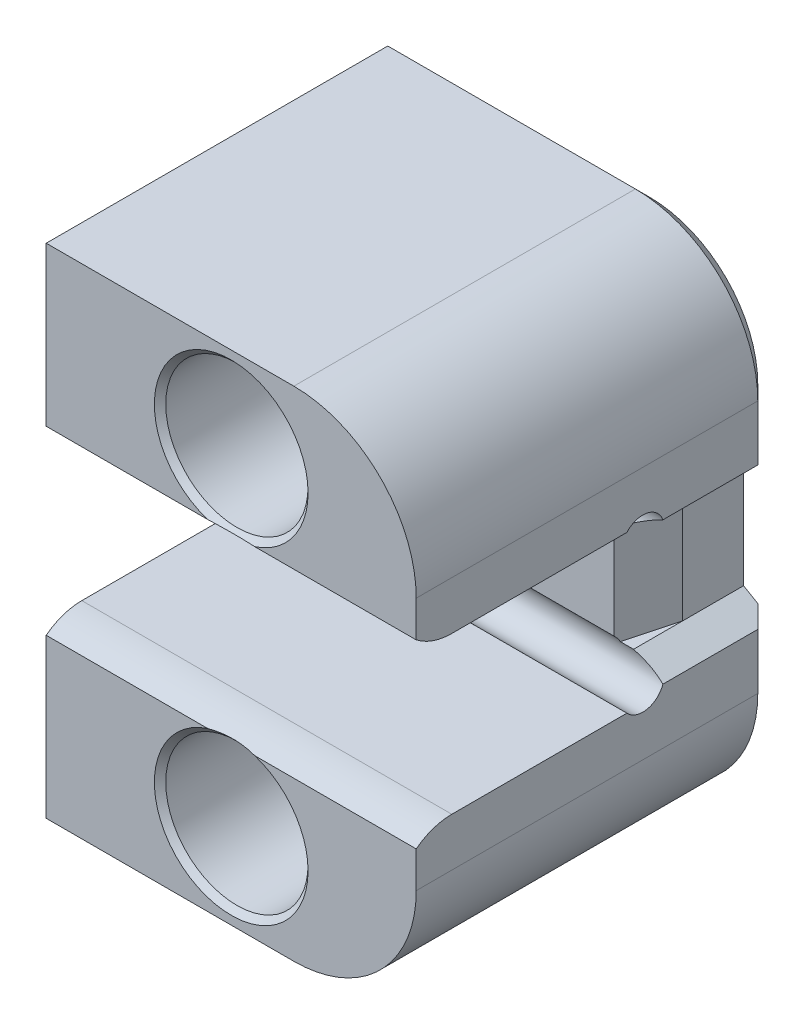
ISO-10303-21;
HEADER;
FILE_DESCRIPTION(('STEP AP214'),'2;1');
FILE_NAME('part.step','',(''),(''),'','','');
FILE_SCHEMA(('AUTOMOTIVE_DESIGN { 1 0 10303 214 1 1 1 1 }'));
ENDSEC;
DATA;
#1=APPLICATION_CONTEXT('core data for automotive mechanical design processes');
#2=APPLICATION_PROTOCOL_DEFINITION('international standard','automotive_design',2000,#1);
#3=PRODUCT_CONTEXT('',#1,'mechanical');
#4=PRODUCT('Part','Part','',(#3));
#5=PRODUCT_RELATED_PRODUCT_CATEGORY('part','',(#4));
#6=PRODUCT_DEFINITION_FORMATION('','',#4);
#7=PRODUCT_DEFINITION_CONTEXT('part definition',#1,'design');
#8=PRODUCT_DEFINITION('design','',#6,#7);
#9=PRODUCT_DEFINITION_SHAPE('','',#8);
#10=(LENGTH_UNIT() NAMED_UNIT(*) SI_UNIT(.MILLI.,.METRE.));
#11=(NAMED_UNIT(*) PLANE_ANGLE_UNIT() SI_UNIT($,.RADIAN.));
#12=(NAMED_UNIT(*) SI_UNIT($,.STERADIAN.) SOLID_ANGLE_UNIT());
#13=UNCERTAINTY_MEASURE_WITH_UNIT(LENGTH_MEASURE(1.E-05),#10,'distance_accuracy_value','');
#14=(GEOMETRIC_REPRESENTATION_CONTEXT(3) GLOBAL_UNCERTAINTY_ASSIGNED_CONTEXT((#13)) GLOBAL_UNIT_ASSIGNED_CONTEXT((#10,
#11,#12)) REPRESENTATION_CONTEXT('',''));
#15=CARTESIAN_POINT('',(0.,0.,0.));
#16=DIRECTION('',(0.,0.,1.));
#17=DIRECTION('',(1.,0.,0.));
#18=AXIS2_PLACEMENT_3D('',#15,#16,#17);
#19=CARTESIAN_POINT('',(13.,-5.5,0.));
#20=DIRECTION('',(-1.,0.,0.));
#21=DIRECTION('',(0.,0.,1.));
#22=AXIS2_PLACEMENT_3D('',#19,#20,#21);
#23=PLANE('',#22);
#24=DIRECTION('',(0.,0.,-1.));
#25=VECTOR('',#24,1.);
#26=CARTESIAN_POINT('',(13.,-8.9,0.));
#27=LINE('',#26,#25);
#28=CARTESIAN_POINT('',(13.,-8.9,0.));
#29=VERTEX_POINT('',#28);
#30=CARTESIAN_POINT('',(13.,-8.9,-24.));
#31=VERTEX_POINT('',#30);
#32=EDGE_CURVE('E282',#29,#31,#27,.T.);
#33=ORIENTED_EDGE('',*,*,#32,.T.);
#34=DIRECTION('',(0.,1.,0.));
#35=VECTOR('',#34,1.);
#36=CARTESIAN_POINT('',(13.,-5.5,-24.));
#37=LINE('',#36,#35);
#38=CARTESIAN_POINT('',(13.,-5.,-24.));
#39=VERTEX_POINT('',#38);
#40=EDGE_CURVE('E301',#31,#39,#37,.T.);
#41=ORIENTED_EDGE('',*,*,#40,.T.);
#42=DIRECTION('',(0.,0.,1.));
#43=VECTOR('',#42,1.);
#44=CARTESIAN_POINT('',(13.,-5.,-25.));
#45=LINE('',#44,#43);
#46=CARTESIAN_POINT('',(13.,-5.,-17.3342135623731));
#47=VERTEX_POINT('',#46);
#48=EDGE_CURVE('E239',#39,#47,#45,.T.);
#49=ORIENTED_EDGE('',*,*,#48,.T.);
#50=CARTESIAN_POINT('',(13.,-4.5,-15.92));
#51=DIRECTION('',(1.,0.,0.));
#52=DIRECTION('',(0.,0.,1.));
#53=AXIS2_PLACEMENT_3D('',#50,#51,#52);
#54=CIRCLE('',#53,1.5);
#55=CARTESIAN_POINT('',(13.,-5.5,-14.8019660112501));
#56=VERTEX_POINT('',#55);
#57=EDGE_CURVE('E479',#56,#47,#54,.T.);
#58=ORIENTED_EDGE('',*,*,#57,.F.);
#59=DIRECTION('',(0.,0.,1.));
#60=VECTOR('',#59,1.);
#61=CARTESIAN_POINT('',(13.,-5.5,-16.92));
#62=LINE('',#61,#60);
#63=CARTESIAN_POINT('',(13.,-5.5,-2.49999999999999));
#64=VERTEX_POINT('',#63);
#65=EDGE_CURVE('E252',#56,#64,#62,.T.);
#66=ORIENTED_EDGE('',*,*,#65,.T.);
#67=CARTESIAN_POINT('',(13.,-9.5673182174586,-2.49999968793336));
#68=DIRECTION('',(-1.,0.,0.));
#69=DIRECTION('',(0.,0.,1.));
#70=AXIS2_PLACEMENT_3D('',#67,#68,#69);
#71=CIRCLE('',#70,4.06731821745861);
#72=CARTESIAN_POINT('',(13.,-6.35903533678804,0.));
#73=VERTEX_POINT('',#72);
#74=EDGE_CURVE('E538',#73,#64,#71,.T.);
#75=ORIENTED_EDGE('',*,*,#74,.F.);
#76=DIRECTION('',(0.,-1.,0.));
#77=VECTOR('',#76,1.);
#78=CARTESIAN_POINT('',(13.,-5.5,0.));
#79=LINE('',#78,#77);
#80=EDGE_CURVE('E254',#73,#29,#79,.T.);
#81=ORIENTED_EDGE('',*,*,#80,.T.);
#82=EDGE_LOOP('',(#33,#41,#49,#58,#66,#75,#81));
#83=FACE_BOUND('',#82,.T.);
#84=ADVANCED_FACE('F33',(#83),#23,.F.);
#85=CARTESIAN_POINT('',(13.,17.5,0.));
#86=DIRECTION('',(0.,0.,-1.));
#87=DIRECTION('',(0.,1.,0.));
#88=AXIS2_PLACEMENT_3D('',#85,#86,#87);
#89=PLANE('',#88);
#90=DIRECTION('',(1.,0.,0.));
#91=VECTOR('',#90,1.);
#92=CARTESIAN_POINT('',(-13.,6.35903533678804,0.));
#93=LINE('',#92,#91);
#94=CARTESIAN_POINT('',(-13.,6.35903533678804,0.));
#95=VERTEX_POINT('',#94);
#96=CARTESIAN_POINT('',(-1.65241711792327,6.35903533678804,0.));
#97=VERTEX_POINT('',#96);
#98=EDGE_CURVE('E539',#95,#97,#93,.T.);
#99=ORIENTED_EDGE('',*,*,#98,.T.);
#100=CARTESIAN_POINT('',(0.,11.5,0.));
#101=DIRECTION('',(0.,0.,-1.));
#102=DIRECTION('',(0.,1.,0.));
#103=AXIS2_PLACEMENT_3D('',#100,#101,#102);
#104=CIRCLE('',#103,5.4);
#105=CARTESIAN_POINT('',(1.65241711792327,6.35903533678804,0.));
#106=VERTEX_POINT('',#105);
#107=EDGE_CURVE('E585',#97,#106,#104,.T.);
#108=ORIENTED_EDGE('',*,*,#107,.T.);
#109=CARTESIAN_POINT('',(13.,6.35903533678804,0.));
#110=VERTEX_POINT('',#109);
#111=EDGE_CURVE('E533',#106,#110,#93,.T.);
#112=ORIENTED_EDGE('',*,*,#111,.T.);
#113=DIRECTION('',(0.,-1.,0.));
#114=VECTOR('',#113,1.);
#115=CARTESIAN_POINT('',(13.,17.5,0.));
#116=LINE('',#115,#114);
#117=CARTESIAN_POINT('',(13.,8.9,0.));
#118=VERTEX_POINT('',#117);
#119=EDGE_CURVE('E245',#118,#110,#116,.T.);
#120=ORIENTED_EDGE('',*,*,#119,.F.);
#121=CARTESIAN_POINT('',(4.4,8.9,0.));
#122=DIRECTION('',(0.,0.,-1.));
#123=DIRECTION('',(0.,1.,0.));
#124=AXIS2_PLACEMENT_3D('',#121,#122,#123);
#125=CIRCLE('',#124,8.6);
#126=CARTESIAN_POINT('',(4.4,17.5,0.));
#127=VERTEX_POINT('',#126);
#128=EDGE_CURVE('E287',#118,#127,#125,.F.);
#129=ORIENTED_EDGE('',*,*,#128,.T.);
#130=DIRECTION('',(-1.,0.,0.));
#131=VECTOR('',#130,1.);
#132=CARTESIAN_POINT('',(13.,17.5,0.));
#133=LINE('',#132,#131);
#134=CARTESIAN_POINT('',(-13.,17.5,0.));
#135=VERTEX_POINT('',#134);
#136=EDGE_CURVE('E256',#127,#135,#133,.T.);
#137=ORIENTED_EDGE('',*,*,#136,.T.);
#138=DIRECTION('',(0.,-1.,0.));
#139=VECTOR('',#138,1.);
#140=CARTESIAN_POINT('',(-13.,17.5,0.));
#141=LINE('',#140,#139);
#142=EDGE_CURVE('E257',#135,#95,#141,.T.);
#143=ORIENTED_EDGE('',*,*,#142,.T.);
#144=EDGE_LOOP('',(#99,#108,#112,#120,#129,#137,#143));
#145=FACE_BOUND('',#144,.T.);
#146=ADVANCED_FACE('F419',(#145),#89,.F.);
#147=CARTESIAN_POINT('',(13.,5.5,0.));
#148=DIRECTION('',(0.,1.,0.));
#149=DIRECTION('',(0.,0.,1.));
#150=AXIS2_PLACEMENT_3D('',#147,#148,#149);
#151=PLANE('',#150);
#152=DIRECTION('',(0.,0.,-1.));
#153=VECTOR('',#152,1.);
#154=CARTESIAN_POINT('',(-13.,5.5,0.));
#155=LINE('',#154,#153);
#156=CARTESIAN_POINT('',(-13.,5.5,-2.49999999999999));
#157=VERTEX_POINT('',#156);
#158=CARTESIAN_POINT('',(-13.,5.5,-14.8019660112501));
#159=VERTEX_POINT('',#158);
#160=EDGE_CURVE('E260',#157,#159,#155,.T.);
#161=ORIENTED_EDGE('',*,*,#160,.T.);
#162=DIRECTION('',(1.,0.,0.));
#163=VECTOR('',#162,1.);
#164=CARTESIAN_POINT('',(-13.,5.5,-14.8019660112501));
#165=LINE('',#164,#163);
#166=CARTESIAN_POINT('',(13.,5.5,-14.8019660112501));
#167=VERTEX_POINT('',#166);
#168=EDGE_CURVE('E526',#159,#167,#165,.T.);
#169=ORIENTED_EDGE('',*,*,#168,.T.);
#170=DIRECTION('',(0.,0.,-1.));
#171=VECTOR('',#170,1.);
#172=CARTESIAN_POINT('',(13.,5.5,0.));
#173=LINE('',#172,#171);
#174=CARTESIAN_POINT('',(13.,5.5,-2.49999999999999));
#175=VERTEX_POINT('',#174);
#176=EDGE_CURVE('E248',#175,#167,#173,.T.);
#177=ORIENTED_EDGE('',*,*,#176,.F.);
#178=DIRECTION('',(1.,0.,0.));
#179=VECTOR('',#178,1.);
#180=CARTESIAN_POINT('',(-13.,5.5,-2.49999999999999));
#181=LINE('',#180,#179);
#182=EDGE_CURVE('E536',#157,#175,#181,.T.);
#183=ORIENTED_EDGE('',*,*,#182,.F.);
#184=EDGE_LOOP('',(#161,#169,#177,#183));
#185=FACE_BOUND('',#184,.T.);
#186=ADVANCED_FACE('F415',(#185),#151,.F.);
#187=CARTESIAN_POINT('',(13.,5.5,-16.92));
#188=DIRECTION('',(0.,0.,-1.));
#189=DIRECTION('',(-1.,0.,0.));
#190=AXIS2_PLACEMENT_3D('',#187,#188,#189);
#191=PLANE('',#190);
#192=DIRECTION('',(1.,0.,0.));
#193=VECTOR('',#192,1.);
#194=CARTESIAN_POINT('',(-13.,-3.38196601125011,-16.92));
#195=LINE('',#194,#193);
#196=CARTESIAN_POINT('',(-13.,-3.3819660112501,-16.92));
#197=VERTEX_POINT('',#196);
#198=CARTESIAN_POINT('',(9.98179306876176,-3.3819660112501,-16.92));
#199=VERTEX_POINT('',#198);
#200=EDGE_CURVE('E514',#197,#199,#195,.T.);
#201=ORIENTED_EDGE('',*,*,#200,.T.);
#202=DIRECTION('',(0.,1.,0.));
#203=VECTOR('',#202,1.);
#204=CARTESIAN_POINT('',(9.98179306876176,-3.84529946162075,-16.92));
#205=LINE('',#204,#203);
#206=CARTESIAN_POINT('',(9.98179306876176,3.3819660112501,-16.92));
#207=VERTEX_POINT('',#206);
#208=EDGE_CURVE('E215',#199,#207,#205,.T.);
#209=ORIENTED_EDGE('',*,*,#208,.T.);
#210=DIRECTION('',(1.,0.,0.));
#211=VECTOR('',#210,1.);
#212=CARTESIAN_POINT('',(-13.,3.38196601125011,-16.92));
#213=LINE('',#212,#211);
#214=CARTESIAN_POINT('',(-13.,3.3819660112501,-16.92));
#215=VERTEX_POINT('',#214);
#216=EDGE_CURVE('E523',#207,#215,#213,.F.);
#217=ORIENTED_EDGE('',*,*,#216,.T.);
#218=DIRECTION('',(0.,-1.,0.));
#219=VECTOR('',#218,1.);
#220=CARTESIAN_POINT('',(-13.,5.5,-16.92));
#221=LINE('',#220,#219);
#222=EDGE_CURVE('E263',#215,#197,#221,.T.);
#223=ORIENTED_EDGE('',*,*,#222,.T.);
#224=EDGE_LOOP('',(#201,#209,#217,#223));
#225=FACE_BOUND('',#224,.T.);
#226=ADVANCED_FACE('F411',(#225),#191,.F.);
#227=CARTESIAN_POINT('',(13.,-5.5,-16.92));
#228=DIRECTION('',(0.,-1.,0.));
#229=DIRECTION('',(0.,0.,-1.));
#230=AXIS2_PLACEMENT_3D('',#227,#228,#229);
#231=PLANE('',#230);
#232=ORIENTED_EDGE('',*,*,#65,.F.);
#233=DIRECTION('',(1.,0.,0.));
#234=VECTOR('',#233,1.);
#235=CARTESIAN_POINT('',(-13.,-5.5,-14.8019660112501));
#236=LINE('',#235,#234);
#237=CARTESIAN_POINT('',(-13.,-5.5,-14.8019660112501));
#238=VERTEX_POINT('',#237);
#239=EDGE_CURVE('E486',#56,#238,#236,.F.);
#240=ORIENTED_EDGE('',*,*,#239,.T.);
#241=DIRECTION('',(0.,0.,1.));
#242=VECTOR('',#241,1.);
#243=CARTESIAN_POINT('',(-13.,-5.5,-16.92));
#244=LINE('',#243,#242);
#245=CARTESIAN_POINT('',(-13.,-5.5,-2.49999999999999));
#246=VERTEX_POINT('',#245);
#247=EDGE_CURVE('E266',#238,#246,#244,.T.);
#248=ORIENTED_EDGE('',*,*,#247,.T.);
#249=DIRECTION('',(1.,0.,0.));
#250=VECTOR('',#249,1.);
#251=CARTESIAN_POINT('',(-13.,-5.5,-2.49999999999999));
#252=LINE('',#251,#250);
#253=EDGE_CURVE('E545',#246,#64,#252,.T.);
#254=ORIENTED_EDGE('',*,*,#253,.T.);
#255=EDGE_LOOP('',(#232,#240,#248,#254));
#256=FACE_BOUND('',#255,.T.);
#257=ADVANCED_FACE('F407',(#256),#231,.F.);
#258=CARTESIAN_POINT('',(13.,-5.5,0.));
#259=DIRECTION('',(0.,0.,-1.));
#260=DIRECTION('',(0.,1.,0.));
#261=AXIS2_PLACEMENT_3D('',#258,#259,#260);
#262=PLANE('',#261);
#263=DIRECTION('',(1.,0.,0.));
#264=VECTOR('',#263,1.);
#265=CARTESIAN_POINT('',(-13.,-6.35903533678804,0.));
#266=LINE('',#265,#264);
#267=CARTESIAN_POINT('',(1.65241711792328,-6.35903533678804,0.));
#268=VERTEX_POINT('',#267);
#269=EDGE_CURVE('E551',#268,#73,#266,.T.);
#270=ORIENTED_EDGE('',*,*,#269,.F.);
#271=CARTESIAN_POINT('',(0.,-11.5,0.));
#272=DIRECTION('',(0.,0.,-1.));
#273=DIRECTION('',(0.,1.,0.));
#274=AXIS2_PLACEMENT_3D('',#271,#272,#273);
#275=CIRCLE('',#274,5.4);
#276=CARTESIAN_POINT('',(-1.65241711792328,-6.35903533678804,0.));
#277=VERTEX_POINT('',#276);
#278=EDGE_CURVE('E351',#268,#277,#275,.T.);
#279=ORIENTED_EDGE('',*,*,#278,.T.);
#280=CARTESIAN_POINT('',(-13.,-6.35903533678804,0.));
#281=VERTEX_POINT('',#280);
#282=EDGE_CURVE('E548',#281,#277,#266,.T.);
#283=ORIENTED_EDGE('',*,*,#282,.F.);
#284=DIRECTION('',(0.,-1.,0.));
#285=VECTOR('',#284,1.);
#286=CARTESIAN_POINT('',(-13.,-5.5,0.));
#287=LINE('',#286,#285);
#288=CARTESIAN_POINT('',(-13.,-17.5,0.));
#289=VERTEX_POINT('',#288);
#290=EDGE_CURVE('E268',#281,#289,#287,.T.);
#291=ORIENTED_EDGE('',*,*,#290,.T.);
#292=DIRECTION('',(-1.,0.,0.));
#293=VECTOR('',#292,1.);
#294=CARTESIAN_POINT('',(13.,-17.5,0.));
#295=LINE('',#294,#293);
#296=CARTESIAN_POINT('',(4.4,-17.5,0.));
#297=VERTEX_POINT('',#296);
#298=EDGE_CURVE('E279',#297,#289,#295,.T.);
#299=ORIENTED_EDGE('',*,*,#298,.F.);
#300=CARTESIAN_POINT('',(4.4,-8.9,0.));
#301=DIRECTION('',(0.,0.,-1.));
#302=DIRECTION('',(0.,1.,0.));
#303=AXIS2_PLACEMENT_3D('',#300,#301,#302);
#304=CIRCLE('',#303,8.6);
#305=EDGE_CURVE('E294',#297,#29,#304,.F.);
#306=ORIENTED_EDGE('',*,*,#305,.T.);
#307=ORIENTED_EDGE('',*,*,#80,.F.);
#308=EDGE_LOOP('',(#270,#279,#283,#291,#299,#306,#307));
#309=FACE_BOUND('',#308,.T.);
#310=ADVANCED_FACE('F403',(#309),#262,.F.);
#311=CARTESIAN_POINT('',(13.,-17.5,0.));
#312=DIRECTION('',(0.,1.,0.));
#313=DIRECTION('',(0.,0.,1.));
#314=AXIS2_PLACEMENT_3D('',#311,#312,#313);
#315=PLANE('',#314);
#316=DIRECTION('',(0.,0.,-1.));
#317=VECTOR('',#316,1.);
#318=CARTESIAN_POINT('',(-13.,-17.5,0.));
#319=LINE('',#318,#317);
#320=CARTESIAN_POINT('',(-13.,-17.5,-24.));
#321=VERTEX_POINT('',#320);
#322=EDGE_CURVE('E270',#289,#321,#319,.T.);
#323=ORIENTED_EDGE('',*,*,#322,.T.);
#324=DIRECTION('',(1.,0.,0.));
#325=VECTOR('',#324,1.);
#326=CARTESIAN_POINT('',(13.,-17.5,-24.));
#327=LINE('',#326,#325);
#328=CARTESIAN_POINT('',(4.4,-17.5,-24.));
#329=VERTEX_POINT('',#328);
#330=EDGE_CURVE('E324',#321,#329,#327,.T.);
#331=ORIENTED_EDGE('',*,*,#330,.T.);
#332=DIRECTION('',(0.,0.,-1.));
#333=VECTOR('',#332,1.);
#334=CARTESIAN_POINT('',(4.4,-17.5,0.));
#335=LINE('',#334,#333);
#336=EDGE_CURVE('E292',#329,#297,#335,.F.);
#337=ORIENTED_EDGE('',*,*,#336,.T.);
#338=ORIENTED_EDGE('',*,*,#298,.T.);
#339=EDGE_LOOP('',(#323,#331,#337,#338));
#340=FACE_BOUND('',#339,.T.);
#341=ADVANCED_FACE('F399',(#340),#315,.F.);
#342=CARTESIAN_POINT('',(13.,17.5,-25.));
#343=DIRECTION('',(0.,0.,1.));
#344=DIRECTION('',(1.,0.,0.));
#345=AXIS2_PLACEMENT_3D('',#342,#343,#344);
#346=PLANE('',#345);
#347=CARTESIAN_POINT('',(0.,11.5,-25.));
#348=DIRECTION('',(0.,0.,1.));
#349=DIRECTION('',(1.,0.,0.));
#350=AXIS2_PLACEMENT_3D('',#347,#348,#349);
#351=CIRCLE('',#350,2.89999999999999);
#352=CARTESIAN_POINT('',(2.89999999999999,11.5,-25.));
#353=VERTEX_POINT('',#352);
#354=EDGE_CURVE('E502',#353,#353,#351,.T.);
#355=ORIENTED_EDGE('',*,*,#354,.T.);
#356=EDGE_LOOP('',(#355));
#357=FACE_BOUND('',#356,.T.);
#358=CARTESIAN_POINT('',(0.,-11.5,-25.));
#359=DIRECTION('',(0.,0.,1.));
#360=DIRECTION('',(1.,0.,0.));
#361=AXIS2_PLACEMENT_3D('',#358,#359,#360);
#362=CIRCLE('',#361,2.89999999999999);
#363=CARTESIAN_POINT('',(2.89999999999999,-11.5,-25.));
#364=VERTEX_POINT('',#363);
#365=EDGE_CURVE('E488',#364,#364,#362,.T.);
#366=ORIENTED_EDGE('',*,*,#365,.T.);
#367=EDGE_LOOP('',(#366));
#368=FACE_BOUND('',#367,.T.);
#369=DIRECTION('',(0.866025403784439,-0.5,0.));
#370=VECTOR('',#369,1.);
#371=CARTESIAN_POINT('',(13.,-5.,-25.));
#372=LINE('',#371,#370);
#373=CARTESIAN_POINT('',(11.,-3.84529946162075,-25.));
#374=VERTEX_POINT('',#373);
#375=CARTESIAN_POINT('',(12.,-4.42264973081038,-25.));
#376=VERTEX_POINT('',#375);
#377=EDGE_CURVE('E241',#374,#376,#372,.T.);
#378=ORIENTED_EDGE('',*,*,#377,.T.);
#379=DIRECTION('',(0.,-1.,0.));
#380=VECTOR('',#379,1.);
#381=CARTESIAN_POINT('',(12.,17.5,-25.));
#382=LINE('',#381,#380);
#383=CARTESIAN_POINT('',(12.,-8.9,-25.));
#384=VERTEX_POINT('',#383);
#385=EDGE_CURVE('E316',#376,#384,#382,.T.);
#386=ORIENTED_EDGE('',*,*,#385,.T.);
#387=CARTESIAN_POINT('',(4.4,-8.9,-25.));
#388=DIRECTION('',(0.,0.,1.));
#389=DIRECTION('',(1.,0.,0.));
#390=AXIS2_PLACEMENT_3D('',#387,#388,#389);
#391=CIRCLE('',#390,7.6);
#392=CARTESIAN_POINT('',(4.4,-16.5,-25.));
#393=VERTEX_POINT('',#392);
#394=EDGE_CURVE('E314',#384,#393,#391,.F.);
#395=ORIENTED_EDGE('',*,*,#394,.T.);
#396=DIRECTION('',(-1.,0.,0.));
#397=VECTOR('',#396,1.);
#398=CARTESIAN_POINT('',(13.,-16.5,-25.));
#399=LINE('',#398,#397);
#400=CARTESIAN_POINT('',(-13.,-16.5,-25.));
#401=VERTEX_POINT('',#400);
#402=EDGE_CURVE('E312',#393,#401,#399,.T.);
#403=ORIENTED_EDGE('',*,*,#402,.T.);
#404=DIRECTION('',(0.,1.,0.));
#405=VECTOR('',#404,1.);
#406=CARTESIAN_POINT('',(-13.,17.5,-25.));
#407=LINE('',#406,#405);
#408=CARTESIAN_POINT('',(-13.,16.5,-25.));
#409=VERTEX_POINT('',#408);
#410=EDGE_CURVE('E273',#401,#409,#407,.T.);
#411=ORIENTED_EDGE('',*,*,#410,.T.);
#412=DIRECTION('',(1.,0.,0.));
#413=VECTOR('',#412,1.);
#414=CARTESIAN_POINT('',(13.,16.5,-25.));
#415=LINE('',#414,#413);
#416=CARTESIAN_POINT('',(4.4,16.5,-25.));
#417=VERTEX_POINT('',#416);
#418=EDGE_CURVE('E306',#409,#417,#415,.T.);
#419=ORIENTED_EDGE('',*,*,#418,.T.);
#420=CARTESIAN_POINT('',(4.4,8.9,-25.));
#421=DIRECTION('',(0.,0.,1.));
#422=DIRECTION('',(1.,0.,0.));
#423=AXIS2_PLACEMENT_3D('',#420,#421,#422);
#424=CIRCLE('',#423,7.59999999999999);
#425=CARTESIAN_POINT('',(12.,8.9,-25.));
#426=VERTEX_POINT('',#425);
#427=EDGE_CURVE('E308',#417,#426,#424,.F.);
#428=ORIENTED_EDGE('',*,*,#427,.T.);
#429=DIRECTION('',(0.,-1.,0.));
#430=VECTOR('',#429,1.);
#431=CARTESIAN_POINT('',(12.,17.5,-25.));
#432=LINE('',#431,#430);
#433=CARTESIAN_POINT('',(12.,4.42264973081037,-25.));
#434=VERTEX_POINT('',#433);
#435=EDGE_CURVE('E310',#426,#434,#432,.T.);
#436=ORIENTED_EDGE('',*,*,#435,.T.);
#437=DIRECTION('',(-0.866025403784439,-0.5,0.));
#438=VECTOR('',#437,1.);
#439=CARTESIAN_POINT('',(13.,5.,-25.));
#440=LINE('',#439,#438);
#441=CARTESIAN_POINT('',(11.,3.84529946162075,-25.));
#442=VERTEX_POINT('',#441);
#443=EDGE_CURVE('E474',#434,#442,#440,.T.);
#444=ORIENTED_EDGE('',*,*,#443,.T.);
#445=DIRECTION('',(0.,-1.,0.));
#446=VECTOR('',#445,1.);
#447=CARTESIAN_POINT('',(11.,-3.84529946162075,-25.));
#448=LINE('',#447,#446);
#449=EDGE_CURVE('E235',#442,#374,#448,.T.);
#450=ORIENTED_EDGE('',*,*,#449,.T.);
#451=EDGE_LOOP('',(#378,#386,#395,#403,#411,#419,#428,#436,#444,#450));
#452=FACE_BOUND('',#451,.T.);
#453=ADVANCED_FACE('F395',(#357,#368,#452),#346,.F.);
#454=CARTESIAN_POINT('',(13.,17.5,0.));
#455=DIRECTION('',(0.,-1.,0.));
#456=DIRECTION('',(0.,0.,-1.));
#457=AXIS2_PLACEMENT_3D('',#454,#455,#456);
#458=PLANE('',#457);
#459=DIRECTION('',(0.,0.,1.));
#460=VECTOR('',#459,1.);
#461=CARTESIAN_POINT('',(4.4,17.5,0.));
#462=LINE('',#461,#460);
#463=CARTESIAN_POINT('',(4.4,17.5,-24.));
#464=VERTEX_POINT('',#463);
#465=EDGE_CURVE('E289',#127,#464,#462,.F.);
#466=ORIENTED_EDGE('',*,*,#465,.T.);
#467=DIRECTION('',(-1.,0.,0.));
#468=VECTOR('',#467,1.);
#469=CARTESIAN_POINT('',(13.,17.5,-24.));
#470=LINE('',#469,#468);
#471=CARTESIAN_POINT('',(-13.,17.5,-24.));
#472=VERTEX_POINT('',#471);
#473=EDGE_CURVE('E333',#464,#472,#470,.T.);
#474=ORIENTED_EDGE('',*,*,#473,.T.);
#475=DIRECTION('',(0.,0.,1.));
#476=VECTOR('',#475,1.);
#477=CARTESIAN_POINT('',(-13.,17.5,0.));
#478=LINE('',#477,#476);
#479=EDGE_CURVE('E249',#472,#135,#478,.T.);
#480=ORIENTED_EDGE('',*,*,#479,.T.);
#481=ORIENTED_EDGE('',*,*,#136,.F.);
#482=EDGE_LOOP('',(#466,#474,#480,#481));
#483=FACE_BOUND('',#482,.T.);
#484=ADVANCED_FACE('F387',(#483),#458,.F.);
#485=DIRECTION('',(0.,0.,1.));
#486=VECTOR('',#485,1.);
#487=CARTESIAN_POINT('',(13.,5.,-25.));
#488=LINE('',#487,#486);
#489=CARTESIAN_POINT('',(13.,5.,-24.));
#490=VERTEX_POINT('',#489);
#491=CARTESIAN_POINT('',(13.,5.,-17.3342135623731));
#492=VERTEX_POINT('',#491);
#493=EDGE_CURVE('E237',#490,#492,#488,.T.);
#494=ORIENTED_EDGE('',*,*,#493,.F.);
#495=DIRECTION('',(0.,1.,0.));
#496=VECTOR('',#495,1.);
#497=CARTESIAN_POINT('',(13.,-5.5,-24.));
#498=LINE('',#497,#496);
#499=CARTESIAN_POINT('',(13.,8.9,-24.));
#500=VERTEX_POINT('',#499);
#501=EDGE_CURVE('E326',#490,#500,#498,.T.);
#502=ORIENTED_EDGE('',*,*,#501,.T.);
#503=DIRECTION('',(0.,0.,1.));
#504=VECTOR('',#503,1.);
#505=CARTESIAN_POINT('',(13.,8.9,0.));
#506=LINE('',#505,#504);
#507=EDGE_CURVE('E285',#500,#118,#506,.T.);
#508=ORIENTED_EDGE('',*,*,#507,.T.);
#509=ORIENTED_EDGE('',*,*,#119,.T.);
#510=CARTESIAN_POINT('',(13.,9.5673182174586,-2.49999968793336));
#511=DIRECTION('',(-1.,0.,0.));
#512=DIRECTION('',(0.,0.,-1.));
#513=AXIS2_PLACEMENT_3D('',#510,#511,#512);
#514=CIRCLE('',#513,4.06731821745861);
#515=EDGE_CURVE('E529',#175,#110,#514,.T.);
#516=ORIENTED_EDGE('',*,*,#515,.F.);
#517=ORIENTED_EDGE('',*,*,#176,.T.);
#518=CARTESIAN_POINT('',(13.,4.5,-15.92));
#519=DIRECTION('',(1.,0.,0.));
#520=DIRECTION('',(0.,0.,-1.));
#521=AXIS2_PLACEMENT_3D('',#518,#519,#520);
#522=CIRCLE('',#521,1.5);
#523=EDGE_CURVE('E519',#492,#167,#522,.T.);
#524=ORIENTED_EDGE('',*,*,#523,.F.);
#525=EDGE_LOOP('',(#494,#502,#508,#509,#516,#517,#524));
#526=FACE_BOUND('',#525,.T.);
#527=ADVANCED_FACE('F383',(#526),#23,.F.);
#528=CARTESIAN_POINT('',(-13.,-5.5,0.));
#529=DIRECTION('',(-1.,0.,0.));
#530=DIRECTION('',(0.,0.,1.));
#531=AXIS2_PLACEMENT_3D('',#528,#529,#530);
#532=PLANE('',#531);
#533=ORIENTED_EDGE('',*,*,#410,.F.);
#534=DIRECTION('',(0.,0.707106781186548,-0.707106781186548));
#535=VECTOR('',#534,1.);
#536=CARTESIAN_POINT('',(-13.,-23.5,-18.));
#537=LINE('',#536,#535);
#538=EDGE_CURVE('E322',#401,#321,#537,.F.);
#539=ORIENTED_EDGE('',*,*,#538,.T.);
#540=ORIENTED_EDGE('',*,*,#322,.F.);
#541=ORIENTED_EDGE('',*,*,#290,.F.);
#542=CARTESIAN_POINT('',(-13.,-9.5673182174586,-2.49999968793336));
#543=DIRECTION('',(-1.,0.,0.));
#544=DIRECTION('',(0.,0.,1.));
#545=AXIS2_PLACEMENT_3D('',#542,#543,#544);
#546=CIRCLE('',#545,4.06731821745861);
#547=EDGE_CURVE('E542',#281,#246,#546,.T.);
#548=ORIENTED_EDGE('',*,*,#547,.T.);
#549=ORIENTED_EDGE('',*,*,#247,.F.);
#550=CARTESIAN_POINT('',(-13.,-4.5,-15.92));
#551=DIRECTION('',(1.,0.,0.));
#552=DIRECTION('',(0.,0.,1.));
#553=AXIS2_PLACEMENT_3D('',#550,#551,#552);
#554=CIRCLE('',#553,1.5);
#555=EDGE_CURVE('E487',#238,#197,#554,.T.);
#556=ORIENTED_EDGE('',*,*,#555,.T.);
#557=ORIENTED_EDGE('',*,*,#222,.F.);
#558=CARTESIAN_POINT('',(-13.,4.5,-15.92));
#559=DIRECTION('',(1.,0.,0.));
#560=DIRECTION('',(0.,0.,-1.));
#561=AXIS2_PLACEMENT_3D('',#558,#559,#560);
#562=CIRCLE('',#561,1.5);
#563=EDGE_CURVE('E520',#215,#159,#562,.T.);
#564=ORIENTED_EDGE('',*,*,#563,.T.);
#565=ORIENTED_EDGE('',*,*,#160,.F.);
#566=CARTESIAN_POINT('',(-13.,9.5673182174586,-2.49999968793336));
#567=DIRECTION('',(-1.,0.,0.));
#568=DIRECTION('',(0.,0.,-1.));
#569=AXIS2_PLACEMENT_3D('',#566,#567,#568);
#570=CIRCLE('',#569,4.06731821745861);
#571=EDGE_CURVE('E530',#157,#95,#570,.T.);
#572=ORIENTED_EDGE('',*,*,#571,.T.);
#573=ORIENTED_EDGE('',*,*,#142,.F.);
#574=ORIENTED_EDGE('',*,*,#479,.F.);
#575=DIRECTION('',(0.,0.70710678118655,0.707106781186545));
#576=VECTOR('',#575,1.);
#577=CARTESIAN_POINT('',(-13.,17.9999999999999,-23.5000000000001));
#578=LINE('',#577,#576);
#579=EDGE_CURVE('E320',#472,#409,#578,.F.);
#580=ORIENTED_EDGE('',*,*,#579,.T.);
#581=EDGE_LOOP('',(#533,#539,#540,#541,#548,#549,#556,#557,#564,#565,#572,#573,#574,#580));
#582=FACE_BOUND('',#581,.T.);
#583=ADVANCED_FACE('F386',(#582),#532,.T.);
#584=CARTESIAN_POINT('',(4.4,8.9,0.));
#585=DIRECTION('',(0.,0.,1.));
#586=DIRECTION('',(1.,0.,0.));
#587=AXIS2_PLACEMENT_3D('',#584,#585,#586);
#588=CYLINDRICAL_SURFACE('',#587,8.6);
#589=ORIENTED_EDGE('',*,*,#507,.F.);
#590=CARTESIAN_POINT('',(4.4,8.9,-24.));
#591=DIRECTION('',(0.,0.,1.));
#592=DIRECTION('',(1.,0.,0.));
#593=AXIS2_PLACEMENT_3D('',#590,#591,#592);
#594=CIRCLE('',#593,8.6);
#595=EDGE_CURVE('E331',#500,#464,#594,.T.);
#596=ORIENTED_EDGE('',*,*,#595,.T.);
#597=ORIENTED_EDGE('',*,*,#465,.F.);
#598=ORIENTED_EDGE('',*,*,#128,.F.);
#599=EDGE_LOOP('',(#589,#596,#597,#598));
#600=FACE_BOUND('',#599,.T.);
#601=ADVANCED_FACE('F391',(#600),#588,.T.);
#602=CARTESIAN_POINT('',(4.4,-8.9,0.));
#603=DIRECTION('',(0.,0.,-1.));
#604=DIRECTION('',(-1.,0.,0.));
#605=AXIS2_PLACEMENT_3D('',#602,#603,#604);
#606=CYLINDRICAL_SURFACE('',#605,8.6);
#607=ORIENTED_EDGE('',*,*,#336,.F.);
#608=CARTESIAN_POINT('',(4.4,-8.9,-24.));
#609=DIRECTION('',(0.,0.,1.));
#610=DIRECTION('',(1.,0.,0.));
#611=AXIS2_PLACEMENT_3D('',#608,#609,#610);
#612=CIRCLE('',#611,8.6);
#613=EDGE_CURVE('E318',#329,#31,#612,.T.);
#614=ORIENTED_EDGE('',*,*,#613,.T.);
#615=ORIENTED_EDGE('',*,*,#32,.F.);
#616=ORIENTED_EDGE('',*,*,#305,.F.);
#617=EDGE_LOOP('',(#607,#614,#615,#616));
#618=FACE_BOUND('',#617,.T.);
#619=ADVANCED_FACE('F380',(#618),#606,.T.);
#620=CARTESIAN_POINT('',(11.,-3.84529946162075,-25.));
#621=DIRECTION('',(-1.,0.,0.));
#622=DIRECTION('',(0.,0.,1.));
#623=AXIS2_PLACEMENT_3D('',#620,#621,#622);
#624=PLANE('',#623);
#625=DIRECTION('',(0.,0.,1.));
#626=VECTOR('',#625,1.);
#627=CARTESIAN_POINT('',(11.,3.84529946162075,-25.));
#628=LINE('',#627,#626);
#629=CARTESIAN_POINT('',(11.,3.84529946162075,-20.72));
#630=VERTEX_POINT('',#629);
#631=EDGE_CURVE('E228',#442,#630,#628,.T.);
#632=ORIENTED_EDGE('',*,*,#631,.T.);
#633=DIRECTION('',(0.,1.,0.));
#634=VECTOR('',#633,1.);
#635=CARTESIAN_POINT('',(11.,-3.84529946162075,-20.72));
#636=LINE('',#635,#634);
#637=CARTESIAN_POINT('',(11.,-3.84529946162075,-20.72));
#638=VERTEX_POINT('',#637);
#639=EDGE_CURVE('E207',#638,#630,#636,.T.);
#640=ORIENTED_EDGE('',*,*,#639,.F.);
#641=DIRECTION('',(0.,0.,1.));
#642=VECTOR('',#641,1.);
#643=CARTESIAN_POINT('',(11.,-3.84529946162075,-25.));
#644=LINE('',#643,#642);
#645=EDGE_CURVE('E236',#374,#638,#644,.T.);
#646=ORIENTED_EDGE('',*,*,#645,.F.);
#647=ORIENTED_EDGE('',*,*,#449,.F.);
#648=EDGE_LOOP('',(#632,#640,#646,#647));
#649=FACE_BOUND('',#648,.T.);
#650=ADVANCED_FACE('F233',(#649),#624,.F.);
#651=CARTESIAN_POINT('',(13.,-5.,-25.));
#652=DIRECTION('',(-0.5,-0.866025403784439,0.));
#653=DIRECTION('',(0.866025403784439,-0.5,0.));
#654=AXIS2_PLACEMENT_3D('',#651,#652,#653);
#655=PLANE('',#654);
#656=ORIENTED_EDGE('',*,*,#48,.F.);
#657=DIRECTION('',(0.654653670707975,-0.377964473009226,0.65465367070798));
#658=VECTOR('',#657,1.);
#659=CARTESIAN_POINT('',(13.1237179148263,-5.07142857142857,-23.8762820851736));
#660=LINE('',#659,#658);
#661=EDGE_CURVE('E304',#39,#376,#660,.F.);
#662=ORIENTED_EDGE('',*,*,#661,.T.);
#663=ORIENTED_EDGE('',*,*,#377,.F.);
#664=ORIENTED_EDGE('',*,*,#645,.T.);
#665=DIRECTION('',(0.,0.,-1.));
#666=VECTOR('',#665,1.);
#667=CARTESIAN_POINT('',(11.,-3.84529946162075,-16.92));
#668=LINE('',#667,#666);
#669=CARTESIAN_POINT('',(11.,-3.84529946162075,-17.2695803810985));
#670=VERTEX_POINT('',#669);
#671=EDGE_CURVE('E221',#670,#638,#668,.T.);
#672=ORIENTED_EDGE('',*,*,#671,.F.);
#673=CARTESIAN_POINT('',(12.1339745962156,-4.5,-15.92));
#674=DIRECTION('',(-0.5,-0.866025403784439,0.));
#675=DIRECTION('',(0.866025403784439,-0.5,0.));
#676=AXIS2_PLACEMENT_3D('',#673,#674,#675);
#677=ELLIPSE('',#676,3.,1.5);
#678=EDGE_CURVE('E298',#670,#47,#677,.T.);
#679=ORIENTED_EDGE('',*,*,#678,.T.);
#680=EDGE_LOOP('',(#656,#662,#663,#664,#672,#679));
#681=FACE_BOUND('',#680,.T.);
#682=ADVANCED_FACE('F374',(#681),#655,.F.);
#683=CARTESIAN_POINT('',(13.,5.,-25.));
#684=DIRECTION('',(-0.5,0.866025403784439,0.));
#685=DIRECTION('',(-0.866025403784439,-0.5,0.));
#686=AXIS2_PLACEMENT_3D('',#683,#684,#685);
#687=PLANE('',#686);
#688=ORIENTED_EDGE('',*,*,#443,.F.);
#689=DIRECTION('',(-0.654653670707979,-0.377964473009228,-0.654653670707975));
#690=VECTOR('',#689,1.);
#691=CARTESIAN_POINT('',(10.4019237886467,3.49999999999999,-26.5980762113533));
#692=LINE('',#691,#690);
#693=EDGE_CURVE('E329',#434,#490,#692,.F.);
#694=ORIENTED_EDGE('',*,*,#693,.T.);
#695=ORIENTED_EDGE('',*,*,#493,.T.);
#696=CARTESIAN_POINT('',(12.1339745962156,4.5,-15.92));
#697=DIRECTION('',(-0.5,0.866025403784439,0.));
#698=DIRECTION('',(0.866025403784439,0.5,0.));
#699=AXIS2_PLACEMENT_3D('',#696,#697,#698);
#700=ELLIPSE('',#699,3.,1.5);
#701=CARTESIAN_POINT('',(11.,3.84529946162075,-17.2695803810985));
#702=VERTEX_POINT('',#701);
#703=EDGE_CURVE('E231',#492,#702,#700,.T.);
#704=ORIENTED_EDGE('',*,*,#703,.T.);
#705=DIRECTION('',(0.,0.,-1.));
#706=VECTOR('',#705,1.);
#707=CARTESIAN_POINT('',(11.,3.84529946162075,-16.92));
#708=LINE('',#707,#706);
#709=EDGE_CURVE('E220',#702,#630,#708,.T.);
#710=ORIENTED_EDGE('',*,*,#709,.T.);
#711=ORIENTED_EDGE('',*,*,#631,.F.);
#712=EDGE_LOOP('',(#688,#694,#695,#704,#710,#711));
#713=FACE_BOUND('',#712,.T.);
#714=ADVANCED_FACE('F227',(#713),#687,.F.);
#715=CARTESIAN_POINT('',(-13.,-9.5673182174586,-2.49999968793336));
#716=DIRECTION('',(1.,0.,0.));
#717=DIRECTION('',(0.,0.,-1.));
#718=AXIS2_PLACEMENT_3D('',#715,#716,#717);
#719=CYLINDRICAL_SURFACE('',#718,4.06731821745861);
#720=ORIENTED_EDGE('',*,*,#282,.T.);
#721=CARTESIAN_POINT('',(-1.6524171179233,-6.35903533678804,0.));
#722=CARTESIAN_POINT('',(-1.54697610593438,-6.34460293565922,-0.0185305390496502));
#723=CARTESIAN_POINT('',(-1.44106157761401,-6.33161519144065,-0.0355200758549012));
#724=CARTESIAN_POINT('',(-1.22843065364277,-6.30848807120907,-0.0661786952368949));
#725=CARTESIAN_POINT('',(-1.12171415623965,-6.29834906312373,-0.079847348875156));
#726=CARTESIAN_POINT('',(-0.907595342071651,-6.28087757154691,-0.103627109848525));
#727=CARTESIAN_POINT('',(-0.800192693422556,-6.27354657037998,-0.113736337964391));
#728=CARTESIAN_POINT('',(-0.584958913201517,-6.26167459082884,-0.130211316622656));
#729=CARTESIAN_POINT('',(-0.477127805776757,-6.25713345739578,-0.136577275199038));
#730=CARTESIAN_POINT('',(-0.157266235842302,-6.24778540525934,-0.149695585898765));
#731=CARTESIAN_POINT('',(0.0551455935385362,-6.24693084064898,-0.150920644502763));
#732=CARTESIAN_POINT('',(0.479155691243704,-6.25588996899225,-0.138311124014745));
#733=CARTESIAN_POINT('',(0.690754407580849,-6.26569654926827,-0.124486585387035));
#734=CARTESIAN_POINT('',(0.964106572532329,-6.28543174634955,-0.0974280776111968));
#735=CARTESIAN_POINT('',(1.02691775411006,-6.29045547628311,-0.0905740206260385));
#736=CARTESIAN_POINT('',(1.15230473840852,-6.30147291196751,-0.0756606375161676));
#737=CARTESIAN_POINT('',(1.21488057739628,-6.30746646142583,-0.067601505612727));
#738=CARTESIAN_POINT('',(1.34012223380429,-6.32046771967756,-0.0502737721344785));
#739=CARTESIAN_POINT('',(1.40278655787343,-6.32748097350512,-0.0409985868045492));
#740=CARTESIAN_POINT('',(1.52782730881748,-6.34250653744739,-0.0213268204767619));
#741=CARTESIAN_POINT('',(1.59020369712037,-6.35051897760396,-0.0109300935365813));
#742=CARTESIAN_POINT('',(1.6524171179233,-6.35903533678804,0.));
#743=B_SPLINE_CURVE_WITH_KNOTS('',3,(#721,#722,#723,#724,#725,#726,#727,#728,#729,#730,#731,
#732,#733,#734,#735,#736,#737,#738,#739,#740,#741,#742),.UNSPECIFIED.,.F.,.F.,(4,2,2,2,2,2,2,2,
2,2,4),(0.,0.324061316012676,0.648164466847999,0.972438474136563,1.29669445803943,
1.93309418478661,2.56906959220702,2.7592090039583,2.94931780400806,3.14050199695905,
3.33171109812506),.UNSPECIFIED.);
#744=EDGE_CURVE('E354',#277,#268,#743,.T.);
#745=ORIENTED_EDGE('',*,*,#744,.T.);
#746=ORIENTED_EDGE('',*,*,#269,.T.);
#747=ORIENTED_EDGE('',*,*,#74,.T.);
#748=ORIENTED_EDGE('',*,*,#253,.F.);
#749=ORIENTED_EDGE('',*,*,#547,.F.);
#750=EDGE_LOOP('',(#720,#745,#746,#747,#748,#749));
#751=FACE_BOUND('',#750,.T.);
#752=ADVANCED_FACE('F365',(#751),#719,.T.);
#753=CARTESIAN_POINT('',(-13.,9.5673182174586,-2.49999968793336));
#754=DIRECTION('',(1.,0.,0.));
#755=DIRECTION('',(0.,0.,-1.));
#756=AXIS2_PLACEMENT_3D('',#753,#754,#755);
#757=CYLINDRICAL_SURFACE('',#756,4.06731821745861);
#758=ORIENTED_EDGE('',*,*,#111,.F.);
#759=CARTESIAN_POINT('',(1.6524171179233,6.35903533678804,0.));
#760=CARTESIAN_POINT('',(1.54697610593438,6.34460293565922,-0.0185305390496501));
#761=CARTESIAN_POINT('',(1.44106157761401,6.33161519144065,-0.0355200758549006));
#762=CARTESIAN_POINT('',(1.22843065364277,6.30848807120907,-0.0661786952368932));
#763=CARTESIAN_POINT('',(1.12171415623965,6.29834906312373,-0.0798473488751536));
#764=CARTESIAN_POINT('',(0.907595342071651,6.28087757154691,-0.103627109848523));
#765=CARTESIAN_POINT('',(0.800192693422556,6.27354657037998,-0.113736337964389));
#766=CARTESIAN_POINT('',(0.584958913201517,6.26167459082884,-0.130211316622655));
#767=CARTESIAN_POINT('',(0.477127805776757,6.25713345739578,-0.136577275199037));
#768=CARTESIAN_POINT('',(0.157266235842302,6.24778540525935,-0.149695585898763));
#769=CARTESIAN_POINT('',(-0.0551455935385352,6.24693084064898,-0.150920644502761));
#770=CARTESIAN_POINT('',(-0.479155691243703,6.25588996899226,-0.138311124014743));
#771=CARTESIAN_POINT('',(-0.690754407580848,6.26569654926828,-0.124486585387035));
#772=CARTESIAN_POINT('',(-0.964106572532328,6.28543174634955,-0.0974280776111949));
#773=CARTESIAN_POINT('',(-1.02691775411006,6.29045547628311,-0.0905740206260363));
#774=CARTESIAN_POINT('',(-1.15230473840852,6.30147291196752,-0.0756606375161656));
#775=CARTESIAN_POINT('',(-1.21488057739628,6.30746646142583,-0.0676015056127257));
#776=CARTESIAN_POINT('',(-1.34012223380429,6.32046771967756,-0.0502737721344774));
#777=CARTESIAN_POINT('',(-1.40278655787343,6.32748097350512,-0.0409985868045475));
#778=CARTESIAN_POINT('',(-1.52782730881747,6.34250653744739,-0.0213268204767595));
#779=CARTESIAN_POINT('',(-1.59020369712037,6.35051897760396,-0.0109300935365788));
#780=CARTESIAN_POINT('',(-1.6524171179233,6.35903533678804,0.));
#781=B_SPLINE_CURVE_WITH_KNOTS('',3,(#759,#760,#761,#762,#763,#764,#765,#766,#767,#768,#769,
#770,#771,#772,#773,#774,#775,#776,#777,#778,#779,#780),.UNSPECIFIED.,.F.,.F.,(4,2,2,2,2,2,2,2,
2,2,4),(0.,0.324061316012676,0.648164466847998,0.972438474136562,1.29669445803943,
1.93309418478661,2.56906959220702,2.7592090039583,2.94931780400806,3.14050199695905,
3.33171109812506),.UNSPECIFIED.);
#782=EDGE_CURVE('E56',#106,#97,#781,.T.);
#783=ORIENTED_EDGE('',*,*,#782,.T.);
#784=ORIENTED_EDGE('',*,*,#98,.F.);
#785=ORIENTED_EDGE('',*,*,#571,.F.);
#786=ORIENTED_EDGE('',*,*,#182,.T.);
#787=ORIENTED_EDGE('',*,*,#515,.T.);
#788=EDGE_LOOP('',(#758,#783,#784,#785,#786,#787));
#789=FACE_BOUND('',#788,.T.);
#790=ADVANCED_FACE('F370',(#789),#757,.T.);
#791=CARTESIAN_POINT('',(-13.,4.5,-15.92));
#792=DIRECTION('',(1.,0.,0.));
#793=DIRECTION('',(0.,0.,-1.));
#794=AXIS2_PLACEMENT_3D('',#791,#792,#793);
#795=CYLINDRICAL_SURFACE('',#794,1.5);
#796=ORIENTED_EDGE('',*,*,#216,.F.);
#797=CARTESIAN_POINT('',(9.71384387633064,4.5,-15.92));
#798=DIRECTION('',(-0.96592582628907,0.,-0.258819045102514));
#799=DIRECTION('',(0.258819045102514,0.,-0.96592582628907));
#800=AXIS2_PLACEMENT_3D('',#797,#798,#799);
#801=ELLIPSE('',#800,1.55291427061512,1.5);
#802=CARTESIAN_POINT('',(10.0754628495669,3.84529946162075,-17.2695803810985));
#803=VERTEX_POINT('',#802);
#804=EDGE_CURVE('E346',#207,#803,#801,.F.);
#805=ORIENTED_EDGE('',*,*,#804,.T.);
#806=DIRECTION('',(1.,0.,0.));
#807=VECTOR('',#806,1.);
#808=CARTESIAN_POINT('',(-13.,3.84529946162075,-17.2695803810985));
#809=LINE('',#808,#807);
#810=EDGE_CURVE('E11',#803,#702,#809,.T.);
#811=ORIENTED_EDGE('',*,*,#810,.T.);
#812=ORIENTED_EDGE('',*,*,#703,.F.);
#813=ORIENTED_EDGE('',*,*,#523,.T.);
#814=ORIENTED_EDGE('',*,*,#168,.F.);
#815=ORIENTED_EDGE('',*,*,#563,.F.);
#816=EDGE_LOOP('',(#796,#805,#811,#812,#813,#814,#815));
#817=FACE_BOUND('',#816,.T.);
#818=ADVANCED_FACE('F574',(#817),#795,.F.);
#819=CARTESIAN_POINT('',(-13.,-4.5,-15.92));
#820=DIRECTION('',(1.,0.,0.));
#821=DIRECTION('',(0.,0.,-1.));
#822=AXIS2_PLACEMENT_3D('',#819,#820,#821);
#823=CYLINDRICAL_SURFACE('',#822,1.5);
#824=DIRECTION('',(1.,0.,0.));
#825=VECTOR('',#824,1.);
#826=CARTESIAN_POINT('',(-13.,-3.84529946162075,-17.2695803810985));
#827=LINE('',#826,#825);
#828=CARTESIAN_POINT('',(10.0754628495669,-3.84529946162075,-17.2695803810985));
#829=VERTEX_POINT('',#828);
#830=EDGE_CURVE('E579',#829,#670,#827,.T.);
#831=ORIENTED_EDGE('',*,*,#830,.F.);
#832=CARTESIAN_POINT('',(9.71384387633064,-4.5,-15.92));
#833=DIRECTION('',(-0.96592582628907,0.,-0.258819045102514));
#834=DIRECTION('',(0.258819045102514,0.,-0.96592582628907));
#835=AXIS2_PLACEMENT_3D('',#832,#833,#834);
#836=ELLIPSE('',#835,1.55291427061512,1.5);
#837=EDGE_CURVE('E42',#829,#199,#836,.F.);
#838=ORIENTED_EDGE('',*,*,#837,.T.);
#839=ORIENTED_EDGE('',*,*,#200,.F.);
#840=ORIENTED_EDGE('',*,*,#555,.F.);
#841=ORIENTED_EDGE('',*,*,#239,.F.);
#842=ORIENTED_EDGE('',*,*,#57,.T.);
#843=ORIENTED_EDGE('',*,*,#678,.F.);
#844=EDGE_LOOP('',(#831,#838,#839,#840,#841,#842,#843));
#845=FACE_BOUND('',#844,.T.);
#846=ADVANCED_FACE('F484',(#845),#823,.F.);
#847=CARTESIAN_POINT('',(0.,-11.5,0.));
#848=DIRECTION('',(0.,0.,1.));
#849=DIRECTION('',(1.,0.,0.));
#850=AXIS2_PLACEMENT_3D('',#847,#848,#849);
#851=CYLINDRICAL_SURFACE('',#850,2.9);
#852=ORIENTED_EDGE('',*,*,#365,.F.);
#853=EDGE_LOOP('',(#852));
#854=FACE_BOUND('',#853,.T.);
#855=CARTESIAN_POINT('',(0.,-11.5,-7.5));
#856=DIRECTION('',(0.,0.,1.));
#857=DIRECTION('',(1.,0.,0.));
#858=AXIS2_PLACEMENT_3D('',#855,#856,#857);
#859=CIRCLE('',#858,2.9);
#860=CARTESIAN_POINT('',(2.9,-11.5,-7.5));
#861=VERTEX_POINT('',#860);
#862=EDGE_CURVE('E508',#861,#861,#859,.T.);
#863=ORIENTED_EDGE('',*,*,#862,.T.);
#864=EDGE_LOOP('',(#863));
#865=FACE_BOUND('',#864,.T.);
#866=ADVANCED_FACE('F613',(#854,#865),#851,.F.);
#867=CARTESIAN_POINT('',(2.9,-11.5,-7.5));
#868=DIRECTION('',(0.,0.,-1.));
#869=DIRECTION('',(-1.,0.,0.));
#870=AXIS2_PLACEMENT_3D('',#867,#868,#869);
#871=PLANE('',#870);
#872=ORIENTED_EDGE('',*,*,#862,.F.);
#873=EDGE_LOOP('',(#872));
#874=FACE_BOUND('',#873,.T.);
#875=CARTESIAN_POINT('',(0.,-11.5,-7.5));
#876=DIRECTION('',(0.,0.,1.));
#877=DIRECTION('',(1.,0.,0.));
#878=AXIS2_PLACEMENT_3D('',#875,#876,#877);
#879=CIRCLE('',#878,5.);
#880=CARTESIAN_POINT('',(5.,-11.5,-7.5));
#881=VERTEX_POINT('',#880);
#882=EDGE_CURVE('E505',#881,#881,#879,.T.);
#883=ORIENTED_EDGE('',*,*,#882,.T.);
#884=EDGE_LOOP('',(#883));
#885=FACE_BOUND('',#884,.T.);
#886=ADVANCED_FACE('F608',(#874,#885),#871,.F.);
#887=CARTESIAN_POINT('',(0.,-11.5,0.));
#888=DIRECTION('',(0.,0.,1.));
#889=DIRECTION('',(1.,0.,0.));
#890=AXIS2_PLACEMENT_3D('',#887,#888,#889);
#891=CYLINDRICAL_SURFACE('',#890,5.);
#892=CARTESIAN_POINT('',(0.,-11.5,-0.400000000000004));
#893=DIRECTION('',(0.,0.,-1.));
#894=DIRECTION('',(-1.,0.,0.));
#895=AXIS2_PLACEMENT_3D('',#892,#893,#894);
#896=CIRCLE('',#895,5.);
#897=CARTESIAN_POINT('',(-5.,-11.5,-0.400000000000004));
#898=VERTEX_POINT('',#897);
#899=EDGE_CURVE('E335',#898,#898,#896,.F.);
#900=ORIENTED_EDGE('',*,*,#899,.T.);
#901=EDGE_LOOP('',(#900));
#902=FACE_BOUND('',#901,.T.);
#903=ORIENTED_EDGE('',*,*,#882,.F.);
#904=EDGE_LOOP('',(#903));
#905=FACE_BOUND('',#904,.T.);
#906=ADVANCED_FACE('F604',(#902,#905),#891,.F.);
#907=CARTESIAN_POINT('',(0.,11.5,0.));
#908=DIRECTION('',(0.,0.,1.));
#909=DIRECTION('',(1.,0.,0.));
#910=AXIS2_PLACEMENT_3D('',#907,#908,#909);
#911=CYLINDRICAL_SURFACE('',#910,2.9);
#912=ORIENTED_EDGE('',*,*,#354,.F.);
#913=EDGE_LOOP('',(#912));
#914=FACE_BOUND('',#913,.T.);
#915=CARTESIAN_POINT('',(0.,11.5,-7.5));
#916=DIRECTION('',(0.,0.,1.));
#917=DIRECTION('',(1.,0.,0.));
#918=AXIS2_PLACEMENT_3D('',#915,#916,#917);
#919=CIRCLE('',#918,2.9);
#920=CARTESIAN_POINT('',(2.9,11.5,-7.5));
#921=VERTEX_POINT('',#920);
#922=EDGE_CURVE('E499',#921,#921,#919,.T.);
#923=ORIENTED_EDGE('',*,*,#922,.T.);
#924=EDGE_LOOP('',(#923));
#925=FACE_BOUND('',#924,.T.);
#926=ADVANCED_FACE('F607',(#914,#925),#911,.F.);
#927=CARTESIAN_POINT('',(2.9,11.5,-7.5));
#928=DIRECTION('',(0.,0.,-1.));
#929=DIRECTION('',(-1.,0.,0.));
#930=AXIS2_PLACEMENT_3D('',#927,#928,#929);
#931=PLANE('',#930);
#932=ORIENTED_EDGE('',*,*,#922,.F.);
#933=EDGE_LOOP('',(#932));
#934=FACE_BOUND('',#933,.T.);
#935=CARTESIAN_POINT('',(0.,11.5,-7.5));
#936=DIRECTION('',(0.,0.,1.));
#937=DIRECTION('',(1.,0.,0.));
#938=AXIS2_PLACEMENT_3D('',#935,#936,#937);
#939=CIRCLE('',#938,5.);
#940=CARTESIAN_POINT('',(5.,11.5,-7.5));
#941=VERTEX_POINT('',#940);
#942=EDGE_CURVE('E343',#941,#941,#939,.T.);
#943=ORIENTED_EDGE('',*,*,#942,.T.);
#944=EDGE_LOOP('',(#943));
#945=FACE_BOUND('',#944,.T.);
#946=ADVANCED_FACE('F758',(#934,#945),#931,.F.);
#947=CARTESIAN_POINT('',(0.,11.5,0.));
#948=DIRECTION('',(0.,0.,1.));
#949=DIRECTION('',(1.,0.,0.));
#950=AXIS2_PLACEMENT_3D('',#947,#948,#949);
#951=CYLINDRICAL_SURFACE('',#950,5.);
#952=CARTESIAN_POINT('',(0.,11.5,-0.4));
#953=DIRECTION('',(0.,0.,-1.));
#954=DIRECTION('',(-1.,0.,0.));
#955=AXIS2_PLACEMENT_3D('',#952,#953,#954);
#956=CIRCLE('',#955,5.);
#957=CARTESIAN_POINT('',(-5.,11.5,-0.4));
#958=VERTEX_POINT('',#957);
#959=EDGE_CURVE('E360',#958,#958,#956,.F.);
#960=ORIENTED_EDGE('',*,*,#959,.T.);
#961=EDGE_LOOP('',(#960));
#962=FACE_BOUND('',#961,.T.);
#963=ORIENTED_EDGE('',*,*,#942,.F.);
#964=EDGE_LOOP('',(#963));
#965=FACE_BOUND('',#964,.T.);
#966=ADVANCED_FACE('F442',(#962,#965),#951,.F.);
#967=CARTESIAN_POINT('',(13.,-16.5,-25.));
#968=DIRECTION('',(0.,0.707106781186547,0.707106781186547));
#969=DIRECTION('',(0.,-0.707106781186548,0.707106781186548));
#970=AXIS2_PLACEMENT_3D('',#967,#968,#969);
#971=PLANE('',#970);
#972=ORIENTED_EDGE('',*,*,#538,.F.);
#973=ORIENTED_EDGE('',*,*,#402,.F.);
#974=DIRECTION('',(0.,0.707106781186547,-0.707106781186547));
#975=VECTOR('',#974,1.);
#976=CARTESIAN_POINT('',(4.4,-17.5,-24.));
#977=LINE('',#976,#975);
#978=EDGE_CURVE('E339',#329,#393,#977,.T.);
#979=ORIENTED_EDGE('',*,*,#978,.F.);
#980=ORIENTED_EDGE('',*,*,#330,.F.);
#981=EDGE_LOOP('',(#972,#973,#979,#980));
#982=FACE_BOUND('',#981,.T.);
#983=ADVANCED_FACE('F438',(#982),#971,.F.);
#984=CARTESIAN_POINT('',(4.4,-8.9,-25.));
#985=DIRECTION('',(0.,0.,1.));
#986=DIRECTION('',(1.,0.,0.));
#987=AXIS2_PLACEMENT_3D('',#984,#985,#986);
#988=CONICAL_SURFACE('',#987,7.6,0.785398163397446);
#989=ORIENTED_EDGE('',*,*,#978,.T.);
#990=ORIENTED_EDGE('',*,*,#394,.F.);
#991=DIRECTION('',(-0.707106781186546,0.,-0.707106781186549));
#992=VECTOR('',#991,1.);
#993=CARTESIAN_POINT('',(13.,-8.9,-24.));
#994=LINE('',#993,#992);
#995=EDGE_CURVE('E336',#31,#384,#994,.T.);
#996=ORIENTED_EDGE('',*,*,#995,.F.);
#997=ORIENTED_EDGE('',*,*,#613,.F.);
#998=EDGE_LOOP('',(#989,#990,#996,#997));
#999=FACE_BOUND('',#998,.T.);
#1000=ADVANCED_FACE('F434',(#999),#988,.T.);
#1001=CARTESIAN_POINT('',(13.,-5.5,-24.));
#1002=DIRECTION('',(-0.70710678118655,0.,0.707106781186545));
#1003=DIRECTION('',(0.707106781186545,0.,0.70710678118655));
#1004=AXIS2_PLACEMENT_3D('',#1001,#1002,#1003);
#1005=PLANE('',#1004);
#1006=ORIENTED_EDGE('',*,*,#995,.T.);
#1007=ORIENTED_EDGE('',*,*,#385,.F.);
#1008=ORIENTED_EDGE('',*,*,#661,.F.);
#1009=ORIENTED_EDGE('',*,*,#40,.F.);
#1010=EDGE_LOOP('',(#1006,#1007,#1008,#1009));
#1011=FACE_BOUND('',#1010,.T.);
#1012=ADVANCED_FACE('F430',(#1011),#1005,.F.);
#1013=CARTESIAN_POINT('',(13.,17.5,-24.));
#1014=DIRECTION('',(0.,-0.707106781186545,0.70710678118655));
#1015=DIRECTION('',(0.,-0.70710678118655,-0.707106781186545));
#1016=AXIS2_PLACEMENT_3D('',#1013,#1014,#1015);
#1017=PLANE('',#1016);
#1018=ORIENTED_EDGE('',*,*,#579,.F.);
#1019=ORIENTED_EDGE('',*,*,#473,.F.);
#1020=DIRECTION('',(0.,0.70710678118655,0.707106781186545));
#1021=VECTOR('',#1020,1.);
#1022=CARTESIAN_POINT('',(4.4,16.5,-25.));
#1023=LINE('',#1022,#1021);
#1024=EDGE_CURVE('E340',#417,#464,#1023,.T.);
#1025=ORIENTED_EDGE('',*,*,#1024,.F.);
#1026=ORIENTED_EDGE('',*,*,#418,.F.);
#1027=EDGE_LOOP('',(#1018,#1019,#1025,#1026));
#1028=FACE_BOUND('',#1027,.T.);
#1029=ADVANCED_FACE('F433',(#1028),#1017,.F.);
#1030=CARTESIAN_POINT('',(4.4,8.9,-25.));
#1031=DIRECTION('',(0.,0.,1.));
#1032=DIRECTION('',(1.,0.,0.));
#1033=AXIS2_PLACEMENT_3D('',#1030,#1031,#1032);
#1034=CONICAL_SURFACE('',#1033,7.59999999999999,0.785398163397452);
#1035=ORIENTED_EDGE('',*,*,#1024,.T.);
#1036=ORIENTED_EDGE('',*,*,#595,.F.);
#1037=DIRECTION('',(0.70710678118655,0.,0.707106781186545));
#1038=VECTOR('',#1037,1.);
#1039=CARTESIAN_POINT('',(12.,8.9,-25.));
#1040=LINE('',#1039,#1038);
#1041=EDGE_CURVE('E344',#426,#500,#1040,.T.);
#1042=ORIENTED_EDGE('',*,*,#1041,.F.);
#1043=ORIENTED_EDGE('',*,*,#427,.F.);
#1044=EDGE_LOOP('',(#1035,#1036,#1042,#1043));
#1045=FACE_BOUND('',#1044,.T.);
#1046=ADVANCED_FACE('F447',(#1045),#1034,.T.);
#1047=CARTESIAN_POINT('',(13.,-5.5,-24.));
#1048=DIRECTION('',(-0.707106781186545,0.,0.70710678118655));
#1049=DIRECTION('',(0.70710678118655,0.,0.707106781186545));
#1050=AXIS2_PLACEMENT_3D('',#1047,#1048,#1049);
#1051=PLANE('',#1050);
#1052=ORIENTED_EDGE('',*,*,#693,.F.);
#1053=ORIENTED_EDGE('',*,*,#435,.F.);
#1054=ORIENTED_EDGE('',*,*,#1041,.T.);
#1055=ORIENTED_EDGE('',*,*,#501,.F.);
#1056=EDGE_LOOP('',(#1052,#1053,#1054,#1055));
#1057=FACE_BOUND('',#1056,.T.);
#1058=ADVANCED_FACE('F444',(#1057),#1051,.F.);
#1059=CARTESIAN_POINT('',(0.,-11.5,-0.400000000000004));
#1060=DIRECTION('',(0.,0.,1.));
#1061=DIRECTION('',(1.,0.,0.));
#1062=AXIS2_PLACEMENT_3D('',#1059,#1060,#1061);
#1063=CONICAL_SURFACE('',#1062,5.,0.785398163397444);
#1064=ORIENTED_EDGE('',*,*,#744,.F.);
#1065=ORIENTED_EDGE('',*,*,#278,.F.);
#1066=EDGE_LOOP('',(#1064,#1065));
#1067=FACE_BOUND('',#1066,.T.);
#1068=ORIENTED_EDGE('',*,*,#899,.F.);
#1069=EDGE_LOOP('',(#1068));
#1070=FACE_BOUND('',#1069,.T.);
#1071=ADVANCED_FACE('F362',(#1067,#1070),#1063,.F.);
#1072=CARTESIAN_POINT('',(0.,11.5,-0.4));
#1073=DIRECTION('',(0.,0.,1.));
#1074=DIRECTION('',(1.,0.,0.));
#1075=AXIS2_PLACEMENT_3D('',#1072,#1073,#1074);
#1076=CONICAL_SURFACE('',#1075,5.,0.785398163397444);
#1077=ORIENTED_EDGE('',*,*,#782,.F.);
#1078=ORIENTED_EDGE('',*,*,#107,.F.);
#1079=EDGE_LOOP('',(#1077,#1078));
#1080=FACE_BOUND('',#1079,.T.);
#1081=ORIENTED_EDGE('',*,*,#959,.F.);
#1082=EDGE_LOOP('',(#1081));
#1083=FACE_BOUND('',#1082,.T.);
#1084=ADVANCED_FACE('F35',(#1080,#1083),#1076,.F.);
#1085=CARTESIAN_POINT('',(0.,3.84529946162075,0.));
#1086=DIRECTION('',(0.,1.,0.));
#1087=DIRECTION('',(0.,0.,1.));
#1088=AXIS2_PLACEMENT_3D('',#1085,#1086,#1087);
#1089=PLANE('',#1088);
#1090=DIRECTION('',(-0.258819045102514,0.,0.96592582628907));
#1091=VECTOR('',#1090,1.);
#1092=CARTESIAN_POINT('',(11.,3.84529946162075,-20.72));
#1093=LINE('',#1092,#1091);
#1094=EDGE_CURVE('E210',#630,#803,#1093,.T.);
#1095=ORIENTED_EDGE('',*,*,#1094,.F.);
#1096=ORIENTED_EDGE('',*,*,#709,.F.);
#1097=ORIENTED_EDGE('',*,*,#810,.F.);
#1098=EDGE_LOOP('',(#1095,#1096,#1097));
#1099=FACE_BOUND('',#1098,.T.);
#1100=ADVANCED_FACE('F219',(#1099),#1089,.F.);
#1101=CARTESIAN_POINT('',(11.,-3.84529946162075,-20.72));
#1102=DIRECTION('',(-0.96592582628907,0.,-0.258819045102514));
#1103=DIRECTION('',(-0.258819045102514,0.,0.96592582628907));
#1104=AXIS2_PLACEMENT_3D('',#1101,#1102,#1103);
#1105=PLANE('',#1104);
#1106=ORIENTED_EDGE('',*,*,#208,.F.);
#1107=ORIENTED_EDGE('',*,*,#837,.F.);
#1108=DIRECTION('',(-0.258819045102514,0.,0.96592582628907));
#1109=VECTOR('',#1108,1.);
#1110=CARTESIAN_POINT('',(11.,-3.84529946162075,-20.72));
#1111=LINE('',#1110,#1109);
#1112=EDGE_CURVE('E49',#638,#829,#1111,.T.);
#1113=ORIENTED_EDGE('',*,*,#1112,.F.);
#1114=ORIENTED_EDGE('',*,*,#639,.T.);
#1115=ORIENTED_EDGE('',*,*,#1094,.T.);
#1116=ORIENTED_EDGE('',*,*,#804,.F.);
#1117=EDGE_LOOP('',(#1106,#1107,#1113,#1114,#1115,#1116));
#1118=FACE_BOUND('',#1117,.T.);
#1119=ADVANCED_FACE('F209',(#1118),#1105,.F.);
#1120=CARTESIAN_POINT('',(0.,-3.84529946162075,0.));
#1121=DIRECTION('',(0.,1.,0.));
#1122=DIRECTION('',(0.,0.,1.));
#1123=AXIS2_PLACEMENT_3D('',#1120,#1121,#1122);
#1124=PLANE('',#1123);
#1125=ORIENTED_EDGE('',*,*,#830,.T.);
#1126=ORIENTED_EDGE('',*,*,#671,.T.);
#1127=ORIENTED_EDGE('',*,*,#1112,.T.);
#1128=EDGE_LOOP('',(#1125,#1126,#1127));
#1129=FACE_BOUND('',#1128,.T.);
#1130=ADVANCED_FACE('F850',(#1129),#1124,.T.);
#1131=CLOSED_SHELL('',(#84,#146,#186,#226,#257,#310,#341,#453,#484,#527,#583,#601,#619,#650,
#682,#714,#752,#790,#818,#846,#866,#886,#906,#926,#946,#966,#983,#1000,#1012,#1029,#1046,#1058,
#1071,#1084,#1100,#1119,#1130));
#1132=MANIFOLD_SOLID_BREP('B2',#1131);
#1133=ADVANCED_BREP_SHAPE_REPRESENTATION('',(#18,#1132),#14);
#1134=SHAPE_DEFINITION_REPRESENTATION(#9,#1133);
ENDSEC;
END-ISO-10303-21;
